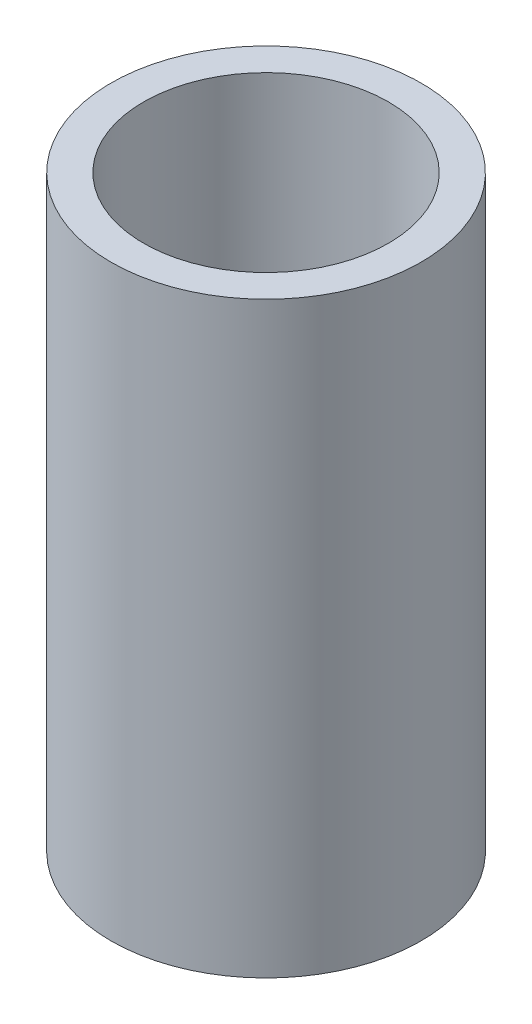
from build123d import *

# Parameters (mm, degrees)
SKETCH3_R          = 30.1625
EXTRUDE1_DEPTH     = 114.3
SKETCH4_R          = 23.8125
CUT_EXTRUDE1_DEPTH = 114.3


with BuildPart() as part:
    # Sketch3 → Extrude1 (new body)
    with BuildSketch(Plane(origin=(0, 0, 0), x_dir=(1, 0, 0), z_dir=(0, 1, 0))):
        with Locations(Location((0, 0, 0), (0, 0, 270))):
            Circle(SKETCH3_R)
    extrude(amount=EXTRUDE1_DEPTH)

    # Sketch4 → Cut-Extrude1 (cut)
    with BuildSketch(Plane.XZ):
        with Locations(Location((0, 0, 0), (0, 0, 270))):
            Circle(SKETCH4_R)
    extrude(amount=-CUT_EXTRUDE1_DEPTH, mode=Mode.SUBTRACT)


solid = part.part
